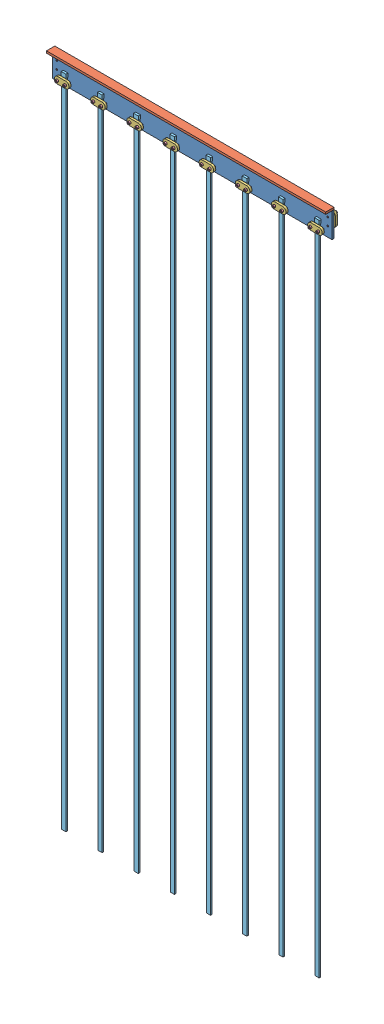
SolidWorks assembly fs-bs-right-mount-assembly-with-led-strips.SLDASM, configuration Default (file format 9000). Lengths in mm.
Overall size (850.9 2044.33 45.12).
42 component instances, 5 part files, 0 mates.
Components (placement in the parent):
- fs-bs-right-mount-assembly-with-screws-1: fs-bs-right-mount-assembly-with-screws.SLDASM [Default] at origin size (850.9 82.55 45.12)
  - fs-bs-right-mount-assembly-1: fs-bs-right-mount-assembly.SLDASM [Default] at origin size (850.9 82.55 38.15)
    - fs-bs-right-mount-vertical-component-1: fs-bs-right-mount-vertical-component.SLDPRT [Default] at origin size (850.9 76.2 6.35)
    - fs-bs-right-mount-horizontal-component-1: fs-bs-right-mount-horizontal-component.SLDPRT [Default] at (425.45 76.2 12.7) size (850.9 6.35 25.4)
    - fs-clamp-1: fs-clamp.SLDPRT [Default] at (27.94 15.24 12.7326) size (44.45 20.32 6.35)
    - fs-clamp-11: fs-clamp.SLDPRT [Default] at (12.7 29.845 -12.7409) x (0 1 0) z (0 0 1) size (44.45 20.32 6.35)
    - fs-clamp-12: fs-clamp.SLDPRT [Default] at (838.2 29.845 -6.3972) x (0 1 0) z (0 0 -1) size (44.45 20.32 6.35)
    - fs-clamp-4: fs-clamp.SLDPRT [Default] at (138.176 15.24 12.7326) size (44.45 20.32 6.35)
    - fs-clamp-5: fs-clamp.SLDPRT [Default] at (248.412 15.24 12.7326) size (44.45 20.32 6.35)
    - fs-clamp-6: fs-clamp.SLDPRT [Default] at (358.648 15.24 12.7326) size (44.45 20.32 6.35)
    - fs-clamp-7: fs-clamp.SLDPRT [Default] at (468.884 15.24 12.7326) size (44.45 20.32 6.35)
    - fs-clamp-8: fs-clamp.SLDPRT [Default] at (579.12 15.24 12.7326) size (44.45 20.32 6.35)
    - fs-clamp-9: fs-clamp.SLDPRT [Default] at (689.356 15.24 12.7326) size (44.45 20.32 6.35)
    - fs-clamp-10: fs-clamp.SLDPRT [Default] at (799.592 15.24 12.7326) size (44.45 20.32 6.35)
  - socket head cap screw_ai-1: socket head cap screw_ai.sldprt [HX-SHCS 0.19-32x0.875x0.875-N] at (52.07 15.24 25.3347) x (0 0 -1) z (0.61191 -0.790927 0) size (27.05 7.94 7.94)
  - socket head cap screw_ai-2: socket head cap screw_ai.sldprt [HX-SHCS 0.19-32x0.875x0.875-N] at (12.7 29.845 -19.6757) x (0 0 1) z (-0.841681 -0.539975 0) size (27.05 7.94 7.94)
  - socket head cap screw_ai-3: socket head cap screw_ai.sldprt [HX-SHCS 0.19-32x0.875x0.875-N] at (12.7 53.975 -19.387) x (0 0 1) z (0.231262 0.972891 0) size (27.05 7.94 7.94)
  - socket head cap screw_ai-4: socket head cap screw_ai.sldprt [HX-SHCS 0.19-32x0.875x0.875-N] at (838.2 29.845 -19.7235) x (0 0 1) z (-0.178736 -0.983897 0) size (27.05 7.94 7.94)
  - socket head cap screw_ai-5: socket head cap screw_ai.sldprt [HX-SHCS 0.19-32x0.875x0.875-N] at (838.2 53.975 -19.4006) x (0 0 1) z (-0.954871 -0.29702 0) size (27.05 7.94 7.94)
  - socket head cap screw_ai-6: socket head cap screw_ai.sldprt [HX-SHCS 0.19-32x0.875x0.875-N] at (27.94 15.24 25.0524) x (0 0 -1) z (-0.570283 0.821448 0) size (27.05 7.94 7.94)
  - socket head cap screw_ai-7: socket head cap screw_ai.sldprt [HX-SHCS 0.19-32x0.875x0.875-N] at (138.176 15.24 25.0524) x (0 0 -1) z (-0.570283 0.821448 0) size (27.05 7.94 7.94)
  - socket head cap screw_ai-8: socket head cap screw_ai.sldprt [HX-SHCS 0.19-32x0.875x0.875-N] at (248.412 15.24 25.0524) x (0 0 -1) z (-0.570283 0.821448 0) size (27.05 7.94 7.94)
  - socket head cap screw_ai-9: socket head cap screw_ai.sldprt [HX-SHCS 0.19-32x0.875x0.875-N] at (358.648 15.24 25.0524) x (0 0 -1) z (-0.570283 0.821448 0) size (27.05 7.94 7.94)
  - socket head cap screw_ai-10: socket head cap screw_ai.sldprt [HX-SHCS 0.19-32x0.875x0.875-N] at (468.884 15.24 25.0524) x (0 0 -1) z (-0.570283 0.821448 0) size (27.05 7.94 7.94)
  - socket head cap screw_ai-11: socket head cap screw_ai.sldprt [HX-SHCS 0.19-32x0.875x0.875-N] at (579.12 15.24 25.0524) x (0 0 -1) z (-0.570283 0.821448 0) size (27.05 7.94 7.94)
  - socket head cap screw_ai-12: socket head cap screw_ai.sldprt [HX-SHCS 0.19-32x0.875x0.875-N] at (689.356 15.24 25.0524) x (0 0 -1) z (-0.570283 0.821448 0) size (27.05 7.94 7.94)
  - socket head cap screw_ai-13: socket head cap screw_ai.sldprt [HX-SHCS 0.19-32x0.875x0.875-N] at (799.592 15.24 25.0524) x (0 0 -1) z (-0.570283 0.821448 0) size (27.05 7.94 7.94)
  - socket head cap screw_ai-14: socket head cap screw_ai.sldprt [HX-SHCS 0.19-32x0.875x0.875-N] at (162.306 15.24 25.3347) x (0 0 -1) z (0.61191 -0.790927 0) size (27.05 7.94 7.94)
  - socket head cap screw_ai-15: socket head cap screw_ai.sldprt [HX-SHCS 0.19-32x0.875x0.875-N] at (272.542 15.24 25.3347) x (0 0 -1) z (0.61191 -0.790927 0) size (27.05 7.94 7.94)
  - socket head cap screw_ai-16: socket head cap screw_ai.sldprt [HX-SHCS 0.19-32x0.875x0.875-N] at (382.778 15.24 25.3347) x (0 0 -1) z (0.61191 -0.790927 0) size (27.05 7.94 7.94)
  - socket head cap screw_ai-17: socket head cap screw_ai.sldprt [HX-SHCS 0.19-32x0.875x0.875-N] at (493.014 15.24 25.3347) x (0 0 -1) z (0.61191 -0.790927 0) size (27.05 7.94 7.94)
  - socket head cap screw_ai-18: socket head cap screw_ai.sldprt [HX-SHCS 0.19-32x0.875x0.875-N] at (603.25 15.24 25.3347) x (0 0 -1) z (0.61191 -0.790927 0) size (27.05 7.94 7.94)
  - socket head cap screw_ai-19: socket head cap screw_ai.sldprt [HX-SHCS 0.19-32x0.875x0.875-N] at (713.486 15.24 25.3347) x (0 0 -1) z (0.61191 -0.790927 0) size (27.05 7.94 7.94)
  - socket head cap screw_ai-20: socket head cap screw_ai.sldprt [HX-SHCS 0.19-32x0.875x0.875-N] at (823.722 15.24 25.3347) x (0 0 -1) z (0.61191 -0.790927 0) size (27.05 7.94 7.94)
- fs-led-strip-1: fs-led-strip.SLDPRT [Default] at (39.8281 32.6608 10.0075) size (14.29 2000 6.35)
- fs-led-strip-2: fs-led-strip.SLDPRT [Default] at (150.0641 32.6608 10.0075) size (14.29 2000 6.35)
- fs-led-strip-3: fs-led-strip.SLDPRT [Default] at (260.3001 32.6608 10.0075) size (14.29 2000 6.35)
- fs-led-strip-4: fs-led-strip.SLDPRT [Default] at (370.5361 32.6608 10.0075) size (14.29 2000 6.35)
- fs-led-strip-5: fs-led-strip.SLDPRT [Default] at (480.7721 32.6608 10.0075) size (14.29 2000 6.35)
- fs-led-strip-6: fs-led-strip.SLDPRT [Default] at (591.0081 32.6608 10.0075) size (14.29 2000 6.35)
- fs-led-strip-7: fs-led-strip.SLDPRT [Default] at (701.2441 32.6608 10.0075) size (14.29 2000 6.35)
- fs-led-strip-8: fs-led-strip.SLDPRT [Default] at (811.4801 32.6608 10.0075) size (14.29 2000 6.35)
